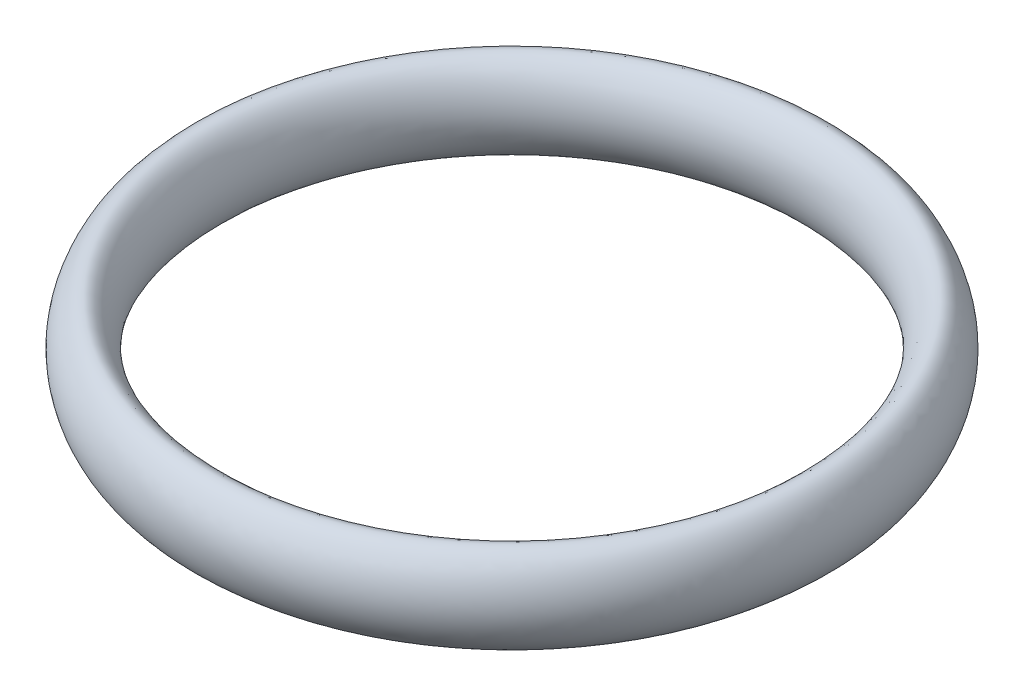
ISO-10303-21;
HEADER;
FILE_DESCRIPTION(('STEP AP214'),'2;1');
FILE_NAME('part.step','',(''),(''),'','','');
FILE_SCHEMA(('AUTOMOTIVE_DESIGN { 1 0 10303 214 1 1 1 1 }'));
ENDSEC;
DATA;
#1=APPLICATION_CONTEXT('core data for automotive mechanical design processes');
#2=APPLICATION_PROTOCOL_DEFINITION('international standard','automotive_design',2000,#1);
#3=PRODUCT_CONTEXT('',#1,'mechanical');
#4=PRODUCT('Part','Part','',(#3));
#5=PRODUCT_RELATED_PRODUCT_CATEGORY('part','',(#4));
#6=PRODUCT_DEFINITION_FORMATION('','',#4);
#7=PRODUCT_DEFINITION_CONTEXT('part definition',#1,'design');
#8=PRODUCT_DEFINITION('design','',#6,#7);
#9=PRODUCT_DEFINITION_SHAPE('','',#8);
#10=(LENGTH_UNIT() NAMED_UNIT(*) SI_UNIT(.MILLI.,.METRE.));
#11=(NAMED_UNIT(*) PLANE_ANGLE_UNIT() SI_UNIT($,.RADIAN.));
#12=(NAMED_UNIT(*) SI_UNIT($,.STERADIAN.) SOLID_ANGLE_UNIT());
#13=UNCERTAINTY_MEASURE_WITH_UNIT(LENGTH_MEASURE(1.E-05),#10,'distance_accuracy_value','');
#14=(GEOMETRIC_REPRESENTATION_CONTEXT(3) GLOBAL_UNCERTAINTY_ASSIGNED_CONTEXT((#13)) GLOBAL_UNIT_ASSIGNED_CONTEXT((#10,
#11,#12)) REPRESENTATION_CONTEXT('',''));
#15=CARTESIAN_POINT('',(0.,0.,0.));
#16=DIRECTION('',(0.,0.,1.));
#17=DIRECTION('',(1.,0.,0.));
#18=AXIS2_PLACEMENT_3D('',#15,#16,#17);
#19=CARTESIAN_POINT('',(-16.43,2.38500000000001,0.));
#20=CARTESIAN_POINT('',(-17.145,2.38500000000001,0.));
#21=CARTESIAN_POINT('',(-18.575,0.,0.));
#22=CARTESIAN_POINT('',(-16.43,-3.57750000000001,0.));
#23=CARTESIAN_POINT('',(-14.285,0.,0.));
#24=CARTESIAN_POINT('',(-15.715,2.38500000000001,0.));
#25=CARTESIAN_POINT('',(-16.43,2.38500000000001,0.));
#26=B_SPLINE_CURVE_WITH_KNOTS('',3,(#19,#20,#21,#22,#23,#24,#25),.UNSPECIFIED.,.T.,.F.,(4,1,1,1,
4),(0.,0.25,0.5,0.75,1.),.UNSPECIFIED.);
#27=CARTESIAN_POINT('',(0.,0.,0.));
#28=DIRECTION('',(0.,-1.,0.));
#29=AXIS1_PLACEMENT('',#27,#28);
#30=SURFACE_OF_REVOLUTION('',#26,#29);
#31=ADVANCED_FACE('F28',(),#30,.T.);
#32=CLOSED_SHELL('',(#31));
#33=MANIFOLD_SOLID_BREP('B2',#32);
#34=ADVANCED_BREP_SHAPE_REPRESENTATION('',(#18,#33),#14);
#35=SHAPE_DEFINITION_REPRESENTATION(#9,#34);
ENDSEC;
END-ISO-10303-21;
